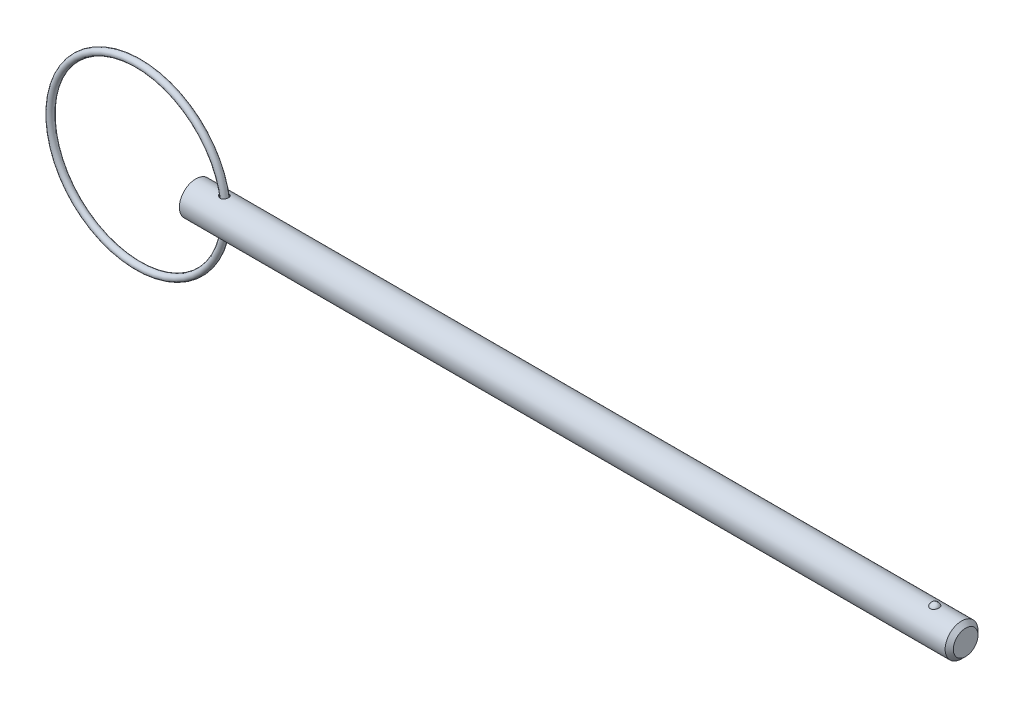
ISO-10303-21;
HEADER;
FILE_DESCRIPTION(('STEP AP214'),'2;1');
FILE_NAME('part.step','',(''),(''),'','','');
FILE_SCHEMA(('AUTOMOTIVE_DESIGN { 1 0 10303 214 1 1 1 1 }'));
ENDSEC;
DATA;
#1=APPLICATION_CONTEXT('core data for automotive mechanical design processes');
#2=APPLICATION_PROTOCOL_DEFINITION('international standard','automotive_design',2000,#1);
#3=PRODUCT_CONTEXT('',#1,'mechanical');
#4=PRODUCT('Part','Part','',(#3));
#5=PRODUCT_RELATED_PRODUCT_CATEGORY('part','',(#4));
#6=PRODUCT_DEFINITION_FORMATION('','',#4);
#7=PRODUCT_DEFINITION_CONTEXT('part definition',#1,'design');
#8=PRODUCT_DEFINITION('design','',#6,#7);
#9=PRODUCT_DEFINITION_SHAPE('','',#8);
#10=(LENGTH_UNIT() NAMED_UNIT(*) SI_UNIT(.MILLI.,.METRE.));
#11=(NAMED_UNIT(*) PLANE_ANGLE_UNIT() SI_UNIT($,.RADIAN.));
#12=(NAMED_UNIT(*) SI_UNIT($,.STERADIAN.) SOLID_ANGLE_UNIT());
#13=UNCERTAINTY_MEASURE_WITH_UNIT(LENGTH_MEASURE(1.E-05),#10,'distance_accuracy_value','');
#14=(GEOMETRIC_REPRESENTATION_CONTEXT(3) GLOBAL_UNCERTAINTY_ASSIGNED_CONTEXT((#13)) GLOBAL_UNIT_ASSIGNED_CONTEXT((#10,
#11,#12)) REPRESENTATION_CONTEXT('',''));
#15=CARTESIAN_POINT('',(0.,0.,0.));
#16=DIRECTION('',(0.,0.,1.));
#17=DIRECTION('',(1.,0.,0.));
#18=AXIS2_PLACEMENT_3D('',#15,#16,#17);
#19=CARTESIAN_POINT('',(-8.3302379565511,0.,0.));
#20=DIRECTION('',(0.,0.,1.));
#21=DIRECTION('',(1.,0.,0.));
#22=AXIS2_PLACEMENT_3D('',#19,#20,#21);
#23=TOROIDAL_SURFACE('',#22,12.7,0.476000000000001);
#24=CARTESIAN_POINT('',(4.8457620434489,0.,0.));
#25=VERTEX_POINT('',#24);
#26=VERTEX_LOOP('',#25);
#27=FACE_BOUND('',#26,.T.);
#28=ADVANCED_FACE('P0_F12',(#27),#23,.T.);
#29=CLOSED_SHELL('',(#28));
#30=MANIFOLD_SOLID_BREP('P0_B1',#29);
#31=CARTESIAN_POINT('',(0.,0.,0.));
#32=DIRECTION('',(1.,0.,0.));
#33=DIRECTION('',(0.,0.,-1.));
#34=AXIS2_PLACEMENT_3D('',#31,#32,#33);
#35=CYLINDRICAL_SURFACE('',#34,2.38);
#36=CARTESIAN_POINT('',(3.67748265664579,2.35074198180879,-0.372037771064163));
#37=CARTESIAN_POINT('',(3.70046616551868,2.34644965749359,-0.399158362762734));
#38=CARTESIAN_POINT('',(3.72581651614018,2.34199234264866,-0.424274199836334));
#39=CARTESIAN_POINT('',(3.78042747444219,2.33326580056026,-0.469907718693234));
#40=CARTESIAN_POINT('',(3.80969342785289,2.32899684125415,-0.490419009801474));
#41=CARTESIAN_POINT('',(3.87128330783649,2.32114904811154,-0.526312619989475));
#42=CARTESIAN_POINT('',(3.90360537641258,2.31756979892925,-0.541698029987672));
#43=CARTESIAN_POINT('',(3.9704452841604,2.31153734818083,-0.566889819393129));
#44=CARTESIAN_POINT('',(4.00496214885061,2.30908365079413,-0.576698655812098));
#45=CARTESIAN_POINT('',(4.07500735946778,2.30564492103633,-0.590297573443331));
#46=CARTESIAN_POINT('',(4.1105275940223,2.30465036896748,-0.594126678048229));
#47=CARTESIAN_POINT('',(4.18170718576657,2.30426876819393,-0.595606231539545));
#48=CARTESIAN_POINT('',(4.21736649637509,2.30488122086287,-0.593258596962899));
#49=CARTESIAN_POINT('',(4.28577822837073,2.30759475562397,-0.582609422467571));
#50=CARTESIAN_POINT('',(4.31858437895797,2.30961492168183,-0.574631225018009));
#51=CARTESIAN_POINT('',(4.38227060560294,2.31483318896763,-0.553233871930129));
#52=CARTESIAN_POINT('',(4.41315097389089,2.31803111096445,-0.539815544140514));
#53=CARTESIAN_POINT('',(4.47118254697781,2.3251225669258,-0.508384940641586));
#54=CARTESIAN_POINT('',(4.49841743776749,2.32899254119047,-0.490521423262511));
#55=CARTESIAN_POINT('',(4.5494826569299,2.33706025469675,-0.450515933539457));
#56=CARTESIAN_POINT('',(4.57331285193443,2.34125800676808,-0.42837379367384));
#57=CARTESIAN_POINT('',(4.6171621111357,2.34956202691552,-0.380209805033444));
#58=CARTESIAN_POINT('',(4.63714543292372,2.35366715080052,-0.354155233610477));
#59=CARTESIAN_POINT('',(4.67254725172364,2.36130301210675,-0.299034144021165));
#60=CARTESIAN_POINT('',(4.68796545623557,2.36483371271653,-0.26996743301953));
#61=CARTESIAN_POINT('',(4.71403776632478,2.37098548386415,-0.209215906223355));
#62=CARTESIAN_POINT('',(4.72462580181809,2.37359383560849,-0.177501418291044));
#63=CARTESIAN_POINT('',(4.74046966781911,2.37755210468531,-0.112692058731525));
#64=CARTESIAN_POINT('',(4.74572552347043,2.37890202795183,-0.0795971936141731));
#65=CARTESIAN_POINT('',(4.75077448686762,2.38019811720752,-0.0129544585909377));
#66=CARTESIAN_POINT('',(4.75056573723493,2.38014380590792,0.0205935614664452));
#67=CARTESIAN_POINT('',(4.74468604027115,2.37863606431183,0.0871753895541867));
#68=CARTESIAN_POINT('',(4.73901506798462,2.37718262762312,0.120209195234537));
#69=CARTESIAN_POINT('',(4.72236472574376,2.37303648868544,0.184779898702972));
#70=CARTESIAN_POINT('',(4.71139268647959,2.37034549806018,0.216318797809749));
#71=CARTESIAN_POINT('',(4.68441400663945,2.36401552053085,0.277063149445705));
#72=CARTESIAN_POINT('',(4.66840715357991,2.36037649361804,0.306268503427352));
#73=CARTESIAN_POINT('',(4.63170627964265,2.35253749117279,0.361595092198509));
#74=CARTESIAN_POINT('',(4.61100040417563,2.34833610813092,0.387708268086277));
#75=CARTESIAN_POINT('',(4.56544852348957,2.33984863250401,0.436017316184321));
#76=CARTESIAN_POINT('',(4.54060272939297,2.33556254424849,0.458213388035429));
#77=CARTESIAN_POINT('',(4.48760111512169,2.32742099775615,0.497916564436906));
#78=CARTESIAN_POINT('',(4.45946763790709,2.32356294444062,0.515452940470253));
#79=CARTESIAN_POINT('',(4.40055109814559,2.31668866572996,0.545520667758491));
#80=CARTESIAN_POINT('',(4.3697684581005,2.31367230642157,0.558052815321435));
#81=CARTESIAN_POINT('',(4.30694930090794,2.30886128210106,0.577633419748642));
#82=CARTESIAN_POINT('',(4.27493988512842,2.30704826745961,0.584764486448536));
#83=CARTESIAN_POINT('',(4.21014558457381,2.30475365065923,0.593744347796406));
#84=CARTESIAN_POINT('',(4.17736068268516,2.30427207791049,0.595593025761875));
#85=CARTESIAN_POINT('',(4.11170515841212,2.30466513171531,0.59406986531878));
#86=CARTESIAN_POINT('',(4.07883545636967,2.30554895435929,0.5906626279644));
#87=CARTESIAN_POINT('',(4.01408593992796,2.30856010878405,0.578780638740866));
#88=CARTESIAN_POINT('',(3.98220636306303,2.31068773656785,0.570304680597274));
#89=CARTESIAN_POINT('',(3.91877258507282,2.31605973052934,0.548090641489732));
#90=CARTESIAN_POINT('',(3.88730095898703,2.31935100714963,0.534128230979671));
#91=CARTESIAN_POINT('',(3.82705133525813,2.32664713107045,0.501391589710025));
#92=CARTESIAN_POINT('',(3.79827429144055,2.33065222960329,0.482615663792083));
#93=CARTESIAN_POINT('',(3.7429634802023,2.3391254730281,0.4397600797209));
#94=CARTESIAN_POINT('',(3.71658313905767,2.3436062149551,0.415484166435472));
#95=CARTESIAN_POINT('',(3.66839516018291,2.35235146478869,0.362706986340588));
#96=CARTESIAN_POINT('',(3.64658727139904,2.35661598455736,0.334205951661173));
#97=CARTESIAN_POINT('',(3.60882605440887,2.36432007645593,0.27436882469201));
#98=CARTESIAN_POINT('',(3.59274982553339,2.36777633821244,0.243112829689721));
#99=CARTESIAN_POINT('',(3.56652169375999,2.3735493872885,0.178112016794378));
#100=CARTESIAN_POINT('',(3.5563653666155,2.3758670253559,0.144369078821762));
#101=CARTESIAN_POINT('',(3.54309691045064,2.37891982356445,0.0783638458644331));
#102=CARTESIAN_POINT('',(3.53947205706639,2.37976992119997,0.0462095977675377));
#103=CARTESIAN_POINT('',(3.53785288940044,2.38014795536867,-0.0182487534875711));
#104=CARTESIAN_POINT('',(3.5398575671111,2.37967612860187,-0.0505528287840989));
#105=CARTESIAN_POINT('',(3.54913867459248,2.37752661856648,-0.112617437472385));
#106=CARTESIAN_POINT('',(3.5561353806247,2.37591295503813,-0.142422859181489));
#107=CARTESIAN_POINT('',(3.5747775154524,2.37172196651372,-0.200451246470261));
#108=CARTESIAN_POINT('',(3.58642049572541,2.36914514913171,-0.228675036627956));
#109=CARTESIAN_POINT('',(3.61071901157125,2.36396321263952,-0.276620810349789));
#110=CARTESIAN_POINT('',(3.62251818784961,2.36150235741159,-0.296799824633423));
#111=CARTESIAN_POINT('',(3.64836661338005,2.35629864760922,-0.335619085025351));
#112=CARTESIAN_POINT('',(3.66241608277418,2.353555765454,-0.354259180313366));
#113=CARTESIAN_POINT('',(3.67748265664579,2.35074198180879,-0.372037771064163));
#114=B_SPLINE_CURVE_WITH_KNOTS('',3,(#36,#37,#38,#39,#40,#41,#42,#43,#44,#45,#46,#47,#48,#49,
#50,#51,#52,#53,#54,#55,#56,#57,#58,#59,#60,#61,#62,#63,#64,#65,#66,#67,#68,#69,#70,#71,#72,#73,
#74,#75,#76,#77,#78,#79,#80,#81,#82,#83,#84,#85,#86,#87,#88,#89,#90,#91,#92,#93,#94,#95,#96,#97,
#98,#99,#100,#101,#102,#103,#104,#105,#106,#107,#108,#109,#110,#111,#112,#113),.UNSPECIFIED.,
.T.,.F.,(4,2,2,2,2,2,2,2,2,2,2,2,2,2,2,2,2,2,2,2,2,2,2,2,2,2,2,2,2,2,2,2,2,2,2,2,2,2,4),(0.,
0.107335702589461,0.214819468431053,0.322238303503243,0.429609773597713,0.536277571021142,
0.642912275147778,0.743874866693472,0.844822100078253,0.942762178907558,1.04070609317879,
1.13952022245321,1.23834068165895,1.33847507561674,1.43860899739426,1.53877695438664,
1.63894536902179,1.7389756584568,1.83901017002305,1.93929990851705,2.03958453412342,
2.13922343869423,2.23884648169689,2.33691317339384,2.43498203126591,2.53371427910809,
2.63247003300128,2.73577311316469,2.83911262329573,2.94697761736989,3.05483668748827,
3.16021984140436,3.2655241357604,3.36212700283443,3.45871257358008,3.55027266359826,
3.64178456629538,3.71214035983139,3.78250304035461),.UNSPECIFIED.);
#115=CARTESIAN_POINT('',(3.67748265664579,2.35074198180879,-0.372037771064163));
#116=VERTEX_POINT('',#115);
#117=EDGE_CURVE('P1_E40',#116,#116,#114,.T.);
#118=ORIENTED_EDGE('',*,*,#117,.T.);
#119=EDGE_LOOP('',(#118));
#120=FACE_BOUND('',#119,.T.);
#121=CARTESIAN_POINT('',(110.835,0.,0.));
#122=DIRECTION('',(1.,0.,0.));
#123=DIRECTION('',(0.,0.,-1.));
#124=AXIS2_PLACEMENT_3D('',#121,#122,#123);
#125=CIRCLE('',#124,2.38);
#126=CARTESIAN_POINT('',(110.835,0.,-2.38));
#127=VERTEX_POINT('',#126);
#128=EDGE_CURVE('P1_E25',#127,#127,#125,.T.);
#129=ORIENTED_EDGE('',*,*,#128,.F.);
#130=EDGE_LOOP('',(#129));
#131=FACE_BOUND('',#130,.T.);
#132=CARTESIAN_POINT('',(0.,0.,0.));
#133=DIRECTION('',(1.,0.,0.));
#134=DIRECTION('',(0.,0.,-1.));
#135=AXIS2_PLACEMENT_3D('',#132,#133,#134);
#136=CIRCLE('',#135,2.38);
#137=CARTESIAN_POINT('',(0.,0.,-2.38));
#138=VERTEX_POINT('',#137);
#139=EDGE_CURVE('P1_E9',#138,#138,#136,.T.);
#140=ORIENTED_EDGE('',*,*,#139,.T.);
#141=EDGE_LOOP('',(#140));
#142=FACE_BOUND('',#141,.T.);
#143=CARTESIAN_POINT('',(106.963449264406,2.2921568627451,0.640637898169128));
#144=CARTESIAN_POINT('',(106.930355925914,2.29215737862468,0.640637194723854));
#145=CARTESIAN_POINT('',(106.897254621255,2.29293179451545,0.637884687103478));
#146=CARTESIAN_POINT('',(106.832017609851,2.29594030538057,0.626968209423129));
#147=CARTESIAN_POINT('',(106.799882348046,2.29817506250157,0.618801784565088));
#148=CARTESIAN_POINT('',(106.737540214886,2.30384308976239,0.597351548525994));
#149=CARTESIAN_POINT('',(106.70733051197,2.30727454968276,0.584075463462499));
#150=CARTESIAN_POINT('',(106.649567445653,2.31495941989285,0.552829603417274));
#151=CARTESIAN_POINT('',(106.62201418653,2.31921286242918,0.534859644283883));
#152=CARTESIAN_POINT('',(106.569593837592,2.32820213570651,0.494282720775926));
#153=CARTESIAN_POINT('',(106.544805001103,2.33294694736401,0.471576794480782));
#154=CARTESIAN_POINT('',(106.499216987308,2.34234144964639,0.422446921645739));
#155=CARTESIAN_POINT('',(106.478418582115,2.34699112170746,0.396022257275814));
#156=CARTESIAN_POINT('',(106.44035804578,2.3559394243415,0.338855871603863));
#157=CARTESIAN_POINT('',(106.423305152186,2.36021170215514,0.307970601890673));
#158=CARTESIAN_POINT('',(106.3943607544,2.3677057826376,0.243750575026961));
#159=CARTESIAN_POINT('',(106.3824701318,2.37092740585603,0.210415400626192));
#160=CARTESIAN_POINT('',(106.363807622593,2.37606901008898,0.141189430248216));
#161=CARTESIAN_POINT('',(106.357195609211,2.37794816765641,0.105252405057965));
#162=CARTESIAN_POINT('',(106.349809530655,2.38005135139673,0.0327351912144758));
#163=CARTESIAN_POINT('',(106.349035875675,2.38027526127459,-0.00384504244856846));
#164=CARTESIAN_POINT('',(106.353362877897,2.37903842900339,-0.0769838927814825));
#165=CARTESIAN_POINT('',(106.35852028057,2.37756141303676,-0.113538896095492));
#166=CARTESIAN_POINT('',(106.374701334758,2.37305303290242,-0.185229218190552));
#167=CARTESIAN_POINT('',(106.385725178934,2.37002161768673,-0.220364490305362));
#168=CARTESIAN_POINT('',(106.413397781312,2.36273722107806,-0.288156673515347));
#169=CARTESIAN_POINT('',(106.430038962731,2.35848588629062,-0.320816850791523));
#170=CARTESIAN_POINT('',(106.468598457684,2.34923130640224,-0.382744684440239));
#171=CARTESIAN_POINT('',(106.490516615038,2.34422808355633,-0.412012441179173));
#172=CARTESIAN_POINT('',(106.538754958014,2.33412555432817,-0.465830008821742));
#173=CARTESIAN_POINT('',(106.565002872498,2.32902887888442,-0.490444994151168));
#174=CARTESIAN_POINT('',(106.621476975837,2.31926941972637,-0.5347003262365));
#175=CARTESIAN_POINT('',(106.651702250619,2.3146065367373,-0.554341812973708));
#176=CARTESIAN_POINT('',(106.714061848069,2.30645675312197,-0.587312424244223));
#177=CARTESIAN_POINT('',(106.746078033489,2.30293152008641,-0.600855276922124));
#178=CARTESIAN_POINT('',(106.812079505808,2.29725171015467,-0.62222045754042));
#179=CARTESIAN_POINT('',(106.846064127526,2.29509667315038,-0.63004470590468));
#180=CARTESIAN_POINT('',(106.913299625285,2.29249264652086,-0.639452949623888));
#181=CARTESIAN_POINT('',(106.946508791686,2.29196755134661,-0.641315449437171));
#182=CARTESIAN_POINT('',(107.012763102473,2.29246849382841,-0.639522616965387));
#183=CARTESIAN_POINT('',(107.045808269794,2.29349430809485,-0.635868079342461));
#184=CARTESIAN_POINT('',(107.110102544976,2.29694059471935,-0.623301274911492));
#185=CARTESIAN_POINT('',(107.141374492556,2.29933234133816,-0.614497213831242));
#186=CARTESIAN_POINT('',(107.201995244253,2.30522511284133,-0.592006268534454));
#187=CARTESIAN_POINT('',(107.231343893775,2.30872622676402,-0.578318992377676));
#188=CARTESIAN_POINT('',(107.288036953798,2.31655795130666,-0.546112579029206));
#189=CARTESIAN_POINT('',(107.315320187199,2.32090569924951,-0.527490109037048));
#190=CARTESIAN_POINT('',(107.366490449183,2.32992206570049,-0.48611785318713));
#191=CARTESIAN_POINT('',(107.390376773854,2.33459075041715,-0.46336721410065));
#192=CARTESIAN_POINT('',(107.435272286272,2.34399834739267,-0.413220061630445));
#193=CARTESIAN_POINT('',(107.456097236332,2.34873051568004,-0.385657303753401));
#194=CARTESIAN_POINT('',(107.493056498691,2.35754932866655,-0.327455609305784));
#195=CARTESIAN_POINT('',(107.509189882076,2.36163584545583,-0.296816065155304));
#196=CARTESIAN_POINT('',(107.5369822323,2.36889321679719,-0.232047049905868));
#197=CARTESIAN_POINT('',(107.548445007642,2.37202275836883,-0.197828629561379));
#198=CARTESIAN_POINT('',(107.565752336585,2.37681926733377,-0.127900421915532));
#199=CARTESIAN_POINT('',(107.571596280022,2.37848607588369,-0.0921904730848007));
#200=CARTESIAN_POINT('',(107.577605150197,2.38020024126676,-0.0196348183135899));
#201=CARTESIAN_POINT('',(107.57767043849,2.38021918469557,0.0172198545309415));
#202=CARTESIAN_POINT('',(107.571868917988,2.37856356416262,0.0904219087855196));
#203=CARTESIAN_POINT('',(107.566001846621,2.37688892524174,0.126769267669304));
#204=CARTESIAN_POINT('',(107.548425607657,2.37201688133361,0.198028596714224));
#205=CARTESIAN_POINT('',(107.536699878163,2.36881516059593,0.232936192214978));
#206=CARTESIAN_POINT('',(107.50763544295,2.36123444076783,0.300196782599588));
#207=CARTESIAN_POINT('',(107.490296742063,2.3568554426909,0.332549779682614));
#208=CARTESIAN_POINT('',(107.450535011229,2.34744667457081,0.393495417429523));
#209=CARTESIAN_POINT('',(107.428152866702,2.34242227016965,0.422115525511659));
#210=CARTESIAN_POINT('',(107.378739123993,2.33227293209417,0.475004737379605));
#211=CARTESIAN_POINT('',(107.351707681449,2.32714800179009,0.499273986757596));
#212=CARTESIAN_POINT('',(107.294498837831,2.31755359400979,0.54204602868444));
#213=CARTESIAN_POINT('',(107.26442973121,2.3130698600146,0.560690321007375));
#214=CARTESIAN_POINT('',(107.201386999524,2.3051412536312,0.592447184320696));
#215=CARTESIAN_POINT('',(107.168415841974,2.30169550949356,0.605564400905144));
#216=CARTESIAN_POINT('',(107.106842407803,2.29677744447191,0.623927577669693));
#217=CARTESIAN_POINT('',(107.07855556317,2.29505839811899,0.630178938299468));
#218=CARTESIAN_POINT('',(107.021330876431,2.29274795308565,0.638534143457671));
#219=CARTESIAN_POINT('',(106.992393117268,2.29215641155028,0.64063851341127));
#220=CARTESIAN_POINT('',(106.963449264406,2.2921568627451,0.640637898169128));
#221=B_SPLINE_CURVE_WITH_KNOTS('',3,(#143,#144,#145,#146,#147,#148,#149,#150,#151,#152,#153,
#154,#155,#156,#157,#158,#159,#160,#161,#162,#163,#164,#165,#166,#167,#168,#169,#170,#171,#172,
#173,#174,#175,#176,#177,#178,#179,#180,#181,#182,#183,#184,#185,#186,#187,#188,#189,#190,#191,
#192,#193,#194,#195,#196,#197,#198,#199,#200,#201,#202,#203,#204,#205,#206,#207,#208,#209,#210,
#211,#212,#213,#214,#215,#216,#217,#218,#219,#220),.UNSPECIFIED.,.T.,.F.,(4,2,2,2,2,2,2,2,2,2,2,
2,2,2,2,2,2,2,2,2,2,2,2,2,2,2,2,2,2,2,2,2,2,2,2,2,2,2,4),(0.,0.0991724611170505,
0.198389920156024,0.297457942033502,0.396529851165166,0.497927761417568,0.599345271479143,
0.705475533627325,0.811623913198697,0.920876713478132,1.03013718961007,1.1404517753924,
1.25076998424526,1.3609399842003,1.47110672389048,1.57959248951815,1.6880533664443,
1.79234266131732,1.89659691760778,1.99590391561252,2.0951966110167,2.19247425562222,
2.28975970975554,2.38926978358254,2.48880044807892,2.5929358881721,2.69709193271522,
2.80525821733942,2.91343624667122,3.02347917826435,3.13352698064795,3.24388765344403,
3.35424823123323,3.46374443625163,3.57323697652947,3.67968690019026,3.78604717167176,
3.87279565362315,3.9595331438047),.UNSPECIFIED.);
#222=CARTESIAN_POINT('',(106.963449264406,2.2921568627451,0.640637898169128));
#223=VERTEX_POINT('',#222);
#224=EDGE_CURVE('P1_E34',#223,#223,#221,.T.);
#225=ORIENTED_EDGE('',*,*,#224,.T.);
#226=EDGE_LOOP('',(#225));
#227=FACE_BOUND('',#226,.T.);
#228=CARTESIAN_POINT('',(3.67748265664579,-2.35074198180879,-0.372037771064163));
#229=CARTESIAN_POINT('',(3.65652023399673,-2.35465684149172,-0.34730037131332));
#230=CARTESIAN_POINT('',(3.63751328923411,-2.35843676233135,-0.320880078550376));
#231=CARTESIAN_POINT('',(3.60404107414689,-2.36534227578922,-0.265218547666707));
#232=CARTESIAN_POINT('',(3.58957485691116,-2.36846800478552,-0.235977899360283));
#233=CARTESIAN_POINT('',(3.56572865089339,-2.37373250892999,-0.17528149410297));
#234=CARTESIAN_POINT('',(3.55636565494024,-2.37586798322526,-0.143818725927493));
#235=CARTESIAN_POINT('',(3.54325775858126,-2.37888184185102,-0.0796854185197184));
#236=CARTESIAN_POINT('',(3.53951093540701,-2.37976065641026,-0.047015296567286));
#237=CARTESIAN_POINT('',(3.53787230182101,-2.38014359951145,0.0167788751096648));
#238=CARTESIAN_POINT('',(3.53968714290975,-2.37971660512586,0.0478953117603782));
#239=CARTESIAN_POINT('',(3.54844977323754,-2.37768530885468,0.10935299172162));
#240=CARTESIAN_POINT('',(3.55539746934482,-2.37608102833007,0.139694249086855));
#241=CARTESIAN_POINT('',(3.57400783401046,-2.37189301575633,0.198451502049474));
#242=CARTESIAN_POINT('',(3.58561918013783,-2.36931996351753,0.226884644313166));
#243=CARTESIAN_POINT('',(3.61310377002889,-2.36345094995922,0.281524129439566));
#244=CARTESIAN_POINT('',(3.62897804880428,-2.36015481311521,0.307729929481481));
#245=CARTESIAN_POINT('',(3.66562367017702,-2.35291979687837,0.359001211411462));
#246=CARTESIAN_POINT('',(3.68664499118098,-2.34895316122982,0.38388386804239));
#247=CARTESIAN_POINT('',(3.73230875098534,-2.34094029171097,0.430056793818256));
#248=CARTESIAN_POINT('',(3.75695270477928,-2.33689402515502,0.451345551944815));
#249=CARTESIAN_POINT('',(3.81128123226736,-2.32880869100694,0.491427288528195));
#250=CARTESIAN_POINT('',(3.84120889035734,-2.32479472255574,0.509896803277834));
#251=CARTESIAN_POINT('',(3.90376464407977,-2.31758417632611,0.541729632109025));
#252=CARTESIAN_POINT('',(3.93639323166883,-2.31438774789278,0.555092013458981));
#253=CARTESIAN_POINT('',(4.00416670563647,-2.30915137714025,0.576493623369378));
#254=CARTESIAN_POINT('',(4.0393485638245,-2.30713552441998,0.584422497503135));
#255=CARTESIAN_POINT('',(4.11060438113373,-2.30465258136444,0.594140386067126));
#256=CARTESIAN_POINT('',(4.14667802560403,-2.30418495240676,0.595931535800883));
#257=CARTESIAN_POINT('',(4.21693481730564,-2.30488473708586,0.593218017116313));
#258=CARTESIAN_POINT('',(4.25112951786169,-2.30597897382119,0.588995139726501));
#259=CARTESIAN_POINT('',(4.31821509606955,-2.30956729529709,0.57476284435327));
#260=CARTESIAN_POINT('',(4.35110629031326,-2.31206103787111,0.564754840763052));
#261=CARTESIAN_POINT('',(4.41316900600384,-2.31802118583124,0.53975368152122));
#262=CARTESIAN_POINT('',(4.44243993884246,-2.32144077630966,0.524995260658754));
#263=CARTESIAN_POINT('',(4.49802365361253,-2.32890801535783,0.49080792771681));
#264=CARTESIAN_POINT('',(4.52433643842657,-2.33295566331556,0.471379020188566));
#265=CARTESIAN_POINT('',(4.57327790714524,-2.3412242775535,0.428422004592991));
#266=CARTESIAN_POINT('',(4.59591094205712,-2.34544503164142,0.404898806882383));
#267=CARTESIAN_POINT('',(4.63697038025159,-2.35360640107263,0.354387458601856));
#268=CARTESIAN_POINT('',(4.65539647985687,-2.35754699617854,0.327399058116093));
#269=CARTESIAN_POINT('',(4.68784943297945,-2.36478461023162,0.270249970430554));
#270=CARTESIAN_POINT('',(4.70180333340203,-2.36807065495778,0.240046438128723));
#271=CARTESIAN_POINT('',(4.72457181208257,-2.3735656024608,0.177668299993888));
#272=CARTESIAN_POINT('',(4.73338630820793,-2.37577448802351,0.145493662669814));
#273=CARTESIAN_POINT('',(4.74568442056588,-2.37888446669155,0.0799353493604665));
#274=CARTESIAN_POINT('',(4.74914498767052,-2.37977990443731,0.0465470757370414));
#275=CARTESIAN_POINT('',(4.7505750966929,-2.38014803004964,-0.0203543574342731));
#276=CARTESIAN_POINT('',(4.74854468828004,-2.37962073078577,-0.0538675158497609));
#277=CARTESIAN_POINT('',(4.73905606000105,-2.37720346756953,-0.119981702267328));
#278=CARTESIAN_POINT('',(4.73161109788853,-2.37531683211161,-0.152584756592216));
#279=CARTESIAN_POINT('',(4.71149336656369,-2.37038779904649,-0.21604453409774));
#280=CARTESIAN_POINT('',(4.69882040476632,-2.36734535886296,-0.246901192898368));
#281=CARTESIAN_POINT('',(4.66852750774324,-2.3604270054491,-0.306062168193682));
#282=CARTESIAN_POINT('',(4.6508974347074,-2.35654938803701,-0.334361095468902));
#283=CARTESIAN_POINT('',(4.61113860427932,-2.34839114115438,-0.387535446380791));
#284=CARTESIAN_POINT('',(4.5890098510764,-2.34411051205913,-0.412410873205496));
#285=CARTESIAN_POINT('',(4.54086484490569,-2.33563475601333,-0.457982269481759));
#286=CARTESIAN_POINT('',(4.51485596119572,-2.33143948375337,-0.478685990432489));
#287=CARTESIAN_POINT('',(4.45962330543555,-2.32360655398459,-0.515369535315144));
#288=CARTESIAN_POINT('',(4.43040000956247,-2.31996881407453,-0.53135005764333));
#289=CARTESIAN_POINT('',(4.37002624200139,-2.31371771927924,-0.557938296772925));
#290=CARTESIAN_POINT('',(4.33891082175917,-2.31108995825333,-0.56862225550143));
#291=CARTESIAN_POINT('',(4.27527207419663,-2.30707117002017,-0.584715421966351));
#292=CARTESIAN_POINT('',(4.24274884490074,-2.30568005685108,-0.590124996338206));
#293=CARTESIAN_POINT('',(4.17738918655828,-2.30427145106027,-0.595601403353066));
#294=CARTESIAN_POINT('',(4.14455499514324,-2.3042474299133,-0.595693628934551));
#295=CARTESIAN_POINT('',(4.07930726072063,-2.30552664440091,-0.590722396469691));
#296=CARTESIAN_POINT('',(4.04689380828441,-2.3068301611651,-0.585657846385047));
#297=CARTESIAN_POINT('',(3.98220150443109,-2.31066076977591,-0.570360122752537));
#298=CARTESIAN_POINT('',(3.94996602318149,-2.31322859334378,-0.559954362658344));
#299=CARTESIAN_POINT('',(3.88760707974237,-2.31930140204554,-0.534242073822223));
#300=CARTESIAN_POINT('',(3.85748403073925,-2.32280656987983,-0.518934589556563));
#301=CARTESIAN_POINT('',(3.80033132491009,-2.33034138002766,-0.483968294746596));
#302=CARTESIAN_POINT('',(3.77327623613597,-2.33436601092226,-0.464349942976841));
#303=CARTESIAN_POINT('',(3.72262060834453,-2.34255524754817,-0.421092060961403));
#304=CARTESIAN_POINT('',(3.69901956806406,-2.34671983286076,-0.397453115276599));
#305=CARTESIAN_POINT('',(3.67748265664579,-2.35074198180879,-0.372037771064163));
#306=B_SPLINE_CURVE_WITH_KNOTS('',3,(#228,#229,#230,#231,#232,#233,#234,#235,#236,#237,#238,
#239,#240,#241,#242,#243,#244,#245,#246,#247,#248,#249,#250,#251,#252,#253,#254,#255,#256,#257,
#258,#259,#260,#261,#262,#263,#264,#265,#266,#267,#268,#269,#270,#271,#272,#273,#274,#275,#276,
#277,#278,#279,#280,#281,#282,#283,#284,#285,#286,#287,#288,#289,#290,#291,#292,#293,#294,#295,
#296,#297,#298,#299,#300,#301,#302,#303,#304,#305),.UNSPECIFIED.,.T.,.F.,(4,2,2,2,2,2,2,2,2,2,2,
2,2,2,2,2,2,2,2,2,2,2,2,2,2,2,2,2,2,2,2,2,2,2,2,2,2,2,4),(0.,0.09787553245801,0.19573064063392,
0.293909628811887,0.39205499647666,0.485114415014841,0.578172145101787,0.670232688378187,
0.762315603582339,0.860342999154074,0.958411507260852,1.06411708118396,1.16984195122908,
1.27765506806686,1.38543067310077,1.48831936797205,1.59118291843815,1.68959047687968,
1.78799793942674,1.88628818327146,1.98458551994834,2.08441314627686,2.18424236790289,
2.28450017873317,2.3847570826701,2.4847693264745,2.58478525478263,2.68500723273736,
2.78522911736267,2.8852630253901,2.98528213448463,3.08381637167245,3.18234375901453,
3.28040059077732,3.37847819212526,3.47994551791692,3.58143263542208,3.68200512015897,
3.78256299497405),.UNSPECIFIED.);
#307=CARTESIAN_POINT('',(3.67748265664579,-2.35074198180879,-0.372037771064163));
#308=VERTEX_POINT('',#307);
#309=EDGE_CURVE('P1_E17',#308,#308,#306,.T.);
#310=ORIENTED_EDGE('',*,*,#309,.T.);
#311=EDGE_LOOP('',(#310));
#312=FACE_BOUND('',#311,.T.);
#313=ADVANCED_FACE('P1_F13',(#120,#131,#142,#227,#312),#35,.T.);
#314=CARTESIAN_POINT('',(0.,0.,0.));
#315=DIRECTION('',(-1.,0.,0.));
#316=DIRECTION('',(0.,0.,1.));
#317=AXIS2_PLACEMENT_3D('',#314,#315,#316);
#318=PLANE('',#317);
#319=ORIENTED_EDGE('',*,*,#139,.F.);
#320=EDGE_LOOP('',(#319));
#321=FACE_BOUND('',#320,.T.);
#322=ADVANCED_FACE('P1_F15',(#321),#318,.T.);
#323=CARTESIAN_POINT('',(111.43,0.,0.));
#324=DIRECTION('',(-1.,0.,0.));
#325=DIRECTION('',(0.,0.,1.));
#326=AXIS2_PLACEMENT_3D('',#323,#324,#325);
#327=CONICAL_SURFACE('',#326,1.78500000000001,0.78539816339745);
#328=ORIENTED_EDGE('',*,*,#128,.T.);
#329=EDGE_LOOP('',(#328));
#330=FACE_BOUND('',#329,.T.);
#331=CARTESIAN_POINT('',(111.43,0.,0.));
#332=DIRECTION('',(1.,0.,0.));
#333=DIRECTION('',(0.,0.,-1.));
#334=AXIS2_PLACEMENT_3D('',#331,#332,#333);
#335=CIRCLE('',#334,1.78500000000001);
#336=CARTESIAN_POINT('',(111.43,0.,-1.78500000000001));
#337=VERTEX_POINT('',#336);
#338=EDGE_CURVE('P1_E30',#337,#337,#335,.T.);
#339=ORIENTED_EDGE('',*,*,#338,.F.);
#340=EDGE_LOOP('',(#339));
#341=FACE_BOUND('',#340,.T.);
#342=ADVANCED_FACE('P1_F55',(#330,#341),#327,.T.);
#343=CARTESIAN_POINT('',(111.43,1.78500000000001,0.));
#344=DIRECTION('',(1.,0.,0.));
#345=DIRECTION('',(0.,0.,-1.));
#346=AXIS2_PLACEMENT_3D('',#343,#344,#345);
#347=PLANE('',#346);
#348=ORIENTED_EDGE('',*,*,#338,.T.);
#349=EDGE_LOOP('',(#348));
#350=FACE_BOUND('',#349,.T.);
#351=ADVANCED_FACE('P1_F51',(#350),#347,.T.);
#352=CARTESIAN_POINT('',(106.963449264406,2.142,0.));
#353=DIRECTION('',(-1.,0.,0.));
#354=DIRECTION('',(0.,1.,0.));
#355=AXIS2_PLACEMENT_3D('',#352,#353,#354);
#356=SPHERICAL_SURFACE('',#355,0.658000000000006);
#357=ORIENTED_EDGE('',*,*,#224,.F.);
#358=EDGE_LOOP('',(#357));
#359=FACE_BOUND('',#358,.T.);
#360=ADVANCED_FACE('P1_F46',(#359),#356,.T.);
#361=CARTESIAN_POINT('',(-8.33023795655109,0.,0.));
#362=DIRECTION('',(0.,0.,1.));
#363=DIRECTION('',(1.,0.,0.));
#364=AXIS2_PLACEMENT_3D('',#361,#362,#363);
#365=TOROIDAL_SURFACE('',#364,12.7,0.594999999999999);
#366=ORIENTED_EDGE('',*,*,#309,.F.);
#367=EDGE_LOOP('',(#366));
#368=FACE_BOUND('',#367,.T.);
#369=ORIENTED_EDGE('',*,*,#117,.F.);
#370=EDGE_LOOP('',(#369));
#371=FACE_BOUND('',#370,.T.);
#372=ADVANCED_FACE('P1_F50',(#368,#371),#365,.F.);
#373=CLOSED_SHELL('',(#313,#322,#342,#351,#360,#372));
#374=MANIFOLD_SOLID_BREP('P1_B1',#373);
#375=ADVANCED_BREP_SHAPE_REPRESENTATION('',(#18,#30,#374),#14);
#376=SHAPE_DEFINITION_REPRESENTATION(#9,#375);
ENDSEC;
END-ISO-10303-21;
